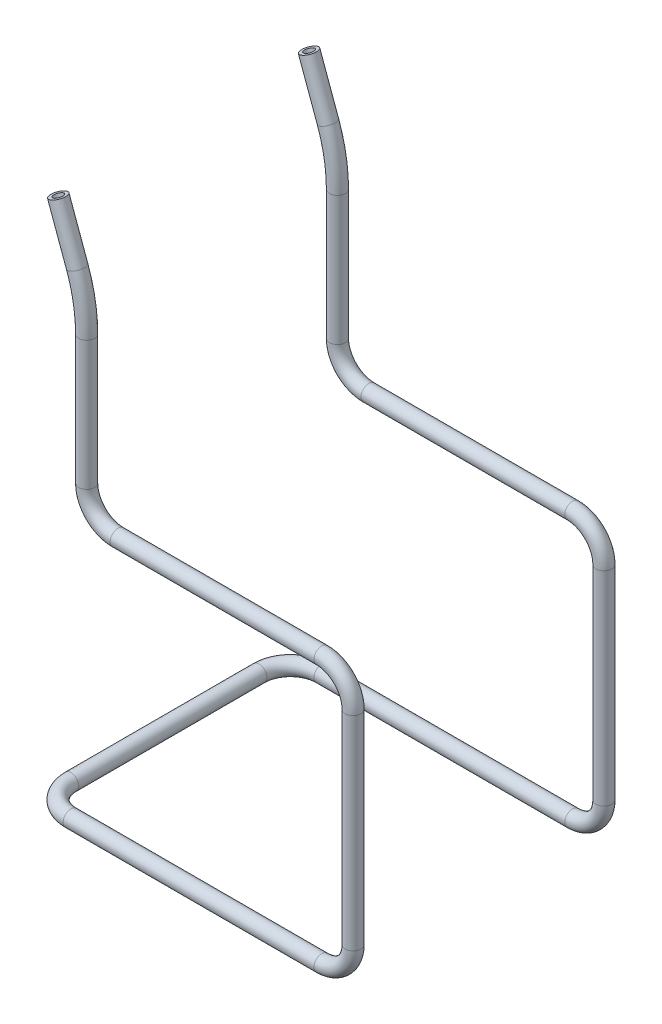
from build123d import *

# Parameters (mm, degrees)
SKETCH1_R   = 2.5
SKETCH1_R_2 = 1.5


with BuildPart() as part:
    # Sweep-Thin1: sweep along a curve in space
    with BuildLine() as sweep_thin1_path:
        Line((0, 0, 0), (0, 0, 30))
        ThreePointArc((0, 0, 30), (2.928932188, 0, 37.071067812), (10, 0, 40))
        Line((10, 0, 40), (90, 0, 40))
        ThreePointArc((90, 0, 40), (97.071067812, 2.928932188, 40), (100, 10, 40))
        Line((100, 10, 40), (100, 75, 40))
        ThreePointArc((100, 75, 40), (97.071067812, 82.071067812, 40), (90, 85, 40))
        Line((90, 85, 40), (25, 85, 40))
        ThreePointArc((25, 85, 40), (17.928932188, 87.928932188, 40), (15, 95, 40))
        Line((15, 95, 40), (15, 136.183650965, 40))
        ThreePointArc((15, 136.183650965, 40), (14.240387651, 144.866059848, 40), (11.984631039, 153.284658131, 40))
        Line((11.984631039, 153.284658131, 40), (5.938507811, 169.896245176, 40))
    # Sketch1 → Sweep-Thin1 (sweep)
    with BuildSketch(Plane.XY):
        Circle(SKETCH1_R)
        Circle(SKETCH1_R_2, mode=Mode.SUBTRACT)
    sweep_thin1 = sweep(path=sweep_thin1_path.line)

    # Mirror1: Sweep-Thin1 across plane
    add(sweep_thin1.mirror(Plane.XY))


solid = part.part
